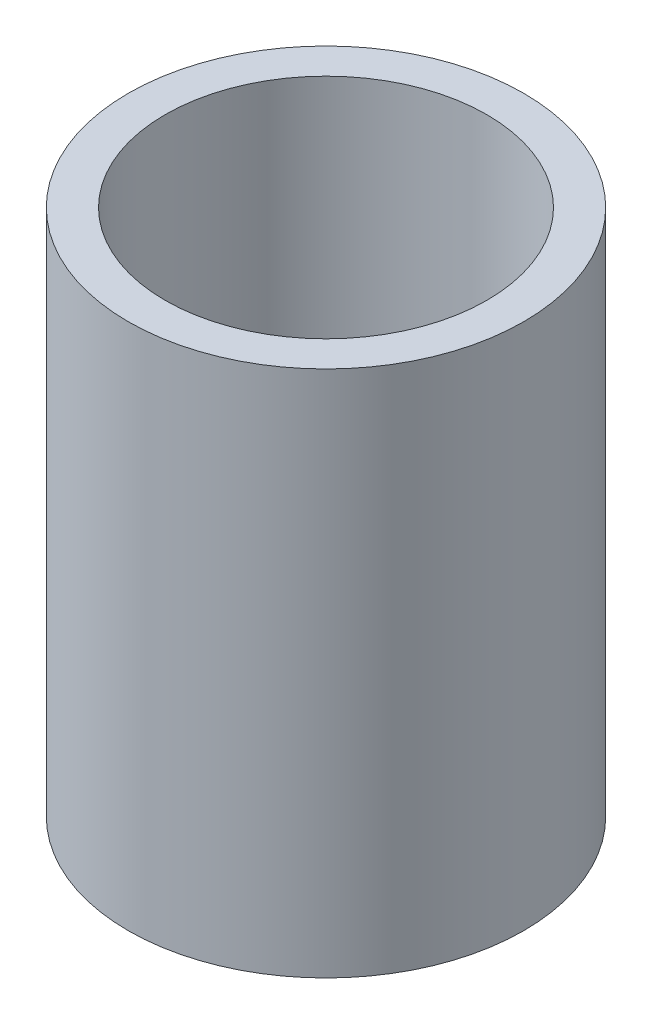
from build123d import *

# Parameters (mm, degrees)
SKETCH1_R           = 4.7625
SKETCH1_R_2         = 3.8735
BOSS_EXTRUDE1_DEPTH = 12.7


with BuildPart() as part:
    # Sketch1 → Boss-Extrude1 (new body)
    with BuildSketch(Plane(origin=(0, 0, 0), x_dir=(1, 0, 0), z_dir=(0, 1, 0))):
        with Locations(Location((0, 0, 0), (0, 0, 270))):
            Circle(SKETCH1_R)
        with Locations(Location((0, 0, 0), (0, 0, 270))):
            Circle(SKETCH1_R_2, mode=Mode.SUBTRACT)
    extrude(amount=-BOSS_EXTRUDE1_DEPTH)


solid = part.part
